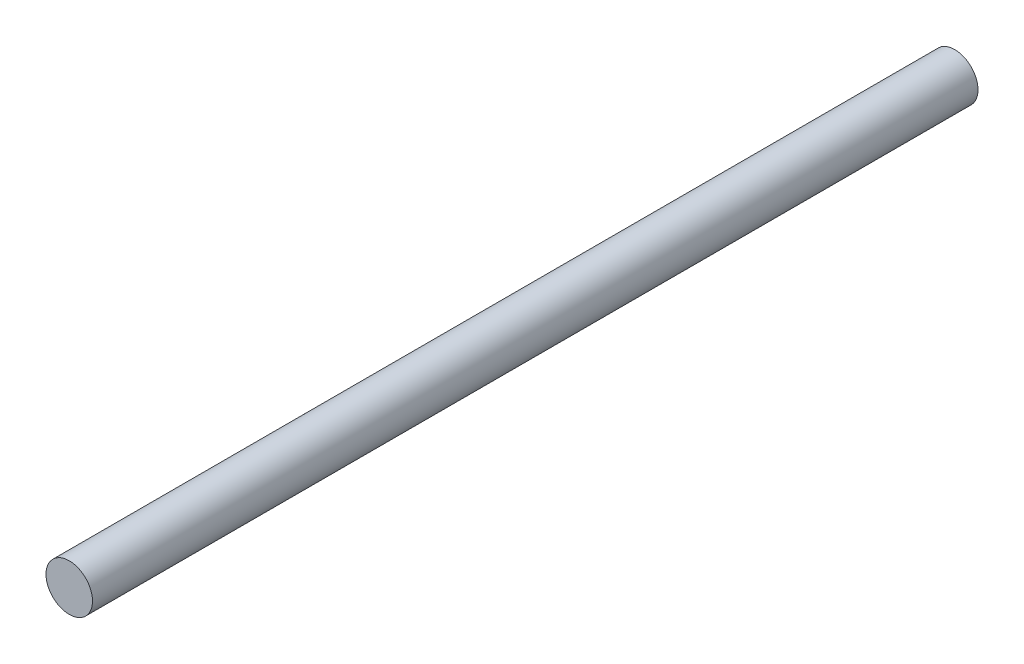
from build123d import *

# Parameters (mm, degrees)
BASE_EXTRUDE_DEPTH      = 347.6625
BASE_EXTRUDE_DEPTH_BACK = 347.6625
SKETCH1_R               = 18.25625


with BuildPart() as part:
    # Sketch1 → Base-Extrude (new, two sides: drawn at the far end of the back side and taken through both)
    with BuildSketch(Plane.XY.offset(-BASE_EXTRUDE_DEPTH_BACK)):
        with Locations(Location((0, 0, 0), (0, 0, 90))):
            Circle(SKETCH1_R)
    extrude(amount=BASE_EXTRUDE_DEPTH + BASE_EXTRUDE_DEPTH_BACK)


solid = part.part
